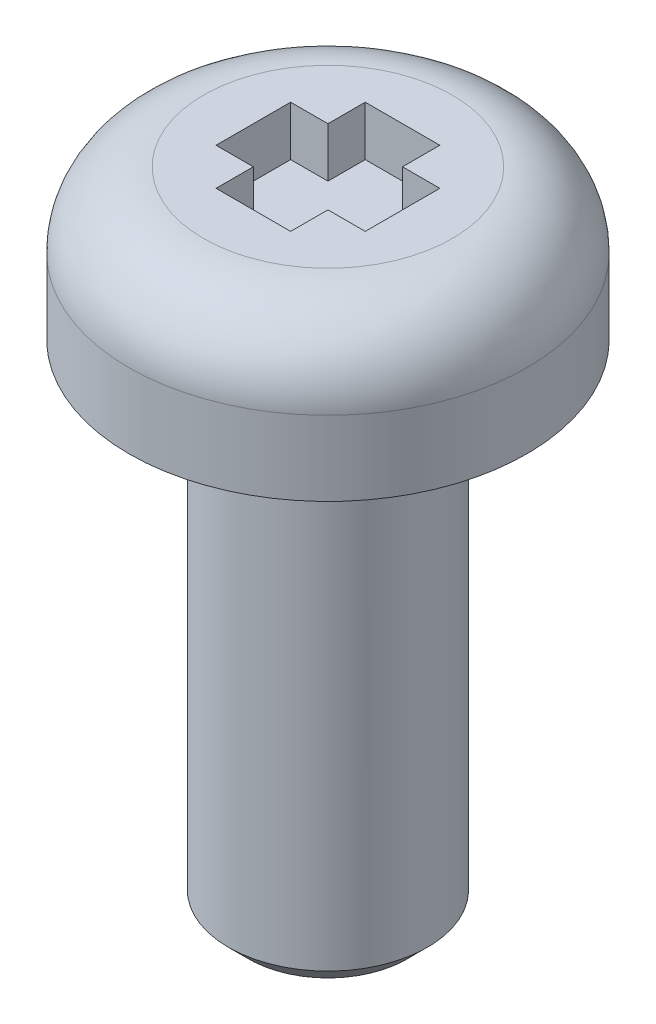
ISO-10303-21;
HEADER;
FILE_DESCRIPTION(('STEP AP214'),'2;1');
FILE_NAME('part.step','',(''),(''),'','','');
FILE_SCHEMA(('AUTOMOTIVE_DESIGN { 1 0 10303 214 1 1 1 1 }'));
ENDSEC;
DATA;
#1=APPLICATION_CONTEXT('core data for automotive mechanical design processes');
#2=APPLICATION_PROTOCOL_DEFINITION('international standard','automotive_design',2000,#1);
#3=PRODUCT_CONTEXT('',#1,'mechanical');
#4=PRODUCT('Part','Part','',(#3));
#5=PRODUCT_RELATED_PRODUCT_CATEGORY('part','',(#4));
#6=PRODUCT_DEFINITION_FORMATION('','',#4);
#7=PRODUCT_DEFINITION_CONTEXT('part definition',#1,'design');
#8=PRODUCT_DEFINITION('design','',#6,#7);
#9=PRODUCT_DEFINITION_SHAPE('','',#8);
#10=(LENGTH_UNIT() NAMED_UNIT(*) SI_UNIT(.MILLI.,.METRE.));
#11=(NAMED_UNIT(*) PLANE_ANGLE_UNIT() SI_UNIT($,.RADIAN.));
#12=(NAMED_UNIT(*) SI_UNIT($,.STERADIAN.) SOLID_ANGLE_UNIT());
#13=UNCERTAINTY_MEASURE_WITH_UNIT(LENGTH_MEASURE(1.E-05),#10,'distance_accuracy_value','');
#14=(GEOMETRIC_REPRESENTATION_CONTEXT(3) GLOBAL_UNCERTAINTY_ASSIGNED_CONTEXT((#13)) GLOBAL_UNIT_ASSIGNED_CONTEXT((#10,
#11,#12)) REPRESENTATION_CONTEXT('',''));
#15=CARTESIAN_POINT('',(0.,0.,0.));
#16=DIRECTION('',(0.,0.,1.));
#17=DIRECTION('',(1.,0.,0.));
#18=AXIS2_PLACEMENT_3D('',#15,#16,#17);
#19=CARTESIAN_POINT('',(4.,0.,0.));
#20=DIRECTION('',(0.,1.,0.));
#21=DIRECTION('',(0.,0.,1.));
#22=AXIS2_PLACEMENT_3D('',#19,#20,#21);
#23=PLANE('',#22);
#24=CARTESIAN_POINT('',(0.,0.,0.));
#25=DIRECTION('',(0.,1.,0.));
#26=DIRECTION('',(0.,0.,1.));
#27=AXIS2_PLACEMENT_3D('',#24,#25,#26);
#28=CIRCLE('',#27,2.4572);
#29=CARTESIAN_POINT('',(0.,0.,2.4572));
#30=VERTEX_POINT('',#29);
#31=EDGE_CURVE('E214',#30,#30,#28,.T.);
#32=ORIENTED_EDGE('',*,*,#31,.T.);
#33=EDGE_LOOP('',(#32));
#34=FACE_BOUND('',#33,.T.);
#35=CARTESIAN_POINT('',(0.,0.,0.));
#36=DIRECTION('',(0.,1.,0.));
#37=DIRECTION('',(0.,0.,1.));
#38=AXIS2_PLACEMENT_3D('',#35,#36,#37);
#39=CIRCLE('',#38,4.);
#40=CARTESIAN_POINT('',(0.,0.,4.));
#41=VERTEX_POINT('',#40);
#42=EDGE_CURVE('E208',#41,#41,#39,.T.);
#43=ORIENTED_EDGE('',*,*,#42,.F.);
#44=EDGE_LOOP('',(#43));
#45=FACE_BOUND('',#44,.T.);
#46=ADVANCED_FACE('F36',(#34,#45),#23,.F.);
#47=CARTESIAN_POINT('',(0.750000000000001,2.,1.5));
#48=DIRECTION('',(1.,0.,0.));
#49=DIRECTION('',(0.,0.,-1.));
#50=AXIS2_PLACEMENT_3D('',#47,#48,#49);
#51=PLANE('',#50);
#52=DIRECTION('',(0.,1.,0.));
#53=VECTOR('',#52,1.);
#54=CARTESIAN_POINT('',(0.75,2.,0.749999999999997));
#55=LINE('',#54,#53);
#56=CARTESIAN_POINT('',(0.750000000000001,2.,0.749999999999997));
#57=VERTEX_POINT('',#56);
#58=CARTESIAN_POINT('',(0.75,3.,0.749999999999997));
#59=VERTEX_POINT('',#58);
#60=EDGE_CURVE('E158',#57,#59,#55,.T.);
#61=ORIENTED_EDGE('',*,*,#60,.F.);
#62=DIRECTION('',(0.,0.,-1.));
#63=VECTOR('',#62,1.);
#64=CARTESIAN_POINT('',(0.750000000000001,2.,1.5));
#65=LINE('',#64,#63);
#66=CARTESIAN_POINT('',(0.750000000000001,2.,1.5));
#67=VERTEX_POINT('',#66);
#68=EDGE_CURVE('E167',#67,#57,#65,.T.);
#69=ORIENTED_EDGE('',*,*,#68,.F.);
#70=DIRECTION('',(0.,1.,0.));
#71=VECTOR('',#70,1.);
#72=CARTESIAN_POINT('',(0.750000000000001,2.,1.5));
#73=LINE('',#72,#71);
#74=CARTESIAN_POINT('',(0.750000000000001,3.,1.5));
#75=VERTEX_POINT('',#74);
#76=EDGE_CURVE('E193',#67,#75,#73,.T.);
#77=ORIENTED_EDGE('',*,*,#76,.T.);
#78=DIRECTION('',(0.,0.,-1.));
#79=VECTOR('',#78,1.);
#80=CARTESIAN_POINT('',(0.750000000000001,3.,1.5));
#81=LINE('',#80,#79);
#82=EDGE_CURVE('E180',#75,#59,#81,.T.);
#83=ORIENTED_EDGE('',*,*,#82,.T.);
#84=EDGE_LOOP('',(#61,#69,#77,#83));
#85=FACE_BOUND('',#84,.T.);
#86=ADVANCED_FACE('F230',(#85),#51,.F.);
#87=CARTESIAN_POINT('',(-0.749999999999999,2.,1.5));
#88=DIRECTION('',(1.,0.,0.));
#89=DIRECTION('',(0.,0.,-1.));
#90=AXIS2_PLACEMENT_3D('',#87,#88,#89);
#91=PLANE('',#90);
#92=DIRECTION('',(0.,0.,-1.));
#93=VECTOR('',#92,1.);
#94=CARTESIAN_POINT('',(-0.749999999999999,2.,1.5));
#95=LINE('',#94,#93);
#96=CARTESIAN_POINT('',(-0.749999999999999,2.,1.5));
#97=VERTEX_POINT('',#96);
#98=CARTESIAN_POINT('',(-0.75,2.,0.75));
#99=VERTEX_POINT('',#98);
#100=EDGE_CURVE('E174',#97,#99,#95,.T.);
#101=ORIENTED_EDGE('',*,*,#100,.T.);
#102=DIRECTION('',(0.,1.,0.));
#103=VECTOR('',#102,1.);
#104=CARTESIAN_POINT('',(-0.75,2.,0.750000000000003));
#105=LINE('',#104,#103);
#106=CARTESIAN_POINT('',(-0.75,3.,0.750000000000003));
#107=VERTEX_POINT('',#106);
#108=EDGE_CURVE('E155',#99,#107,#105,.T.);
#109=ORIENTED_EDGE('',*,*,#108,.T.);
#110=DIRECTION('',(0.,0.,-1.));
#111=VECTOR('',#110,1.);
#112=CARTESIAN_POINT('',(-0.749999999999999,3.,1.5));
#113=LINE('',#112,#111);
#114=CARTESIAN_POINT('',(-0.749999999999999,3.,1.5));
#115=VERTEX_POINT('',#114);
#116=EDGE_CURVE('E187',#115,#107,#113,.T.);
#117=ORIENTED_EDGE('',*,*,#116,.F.);
#118=DIRECTION('',(0.,1.,0.));
#119=VECTOR('',#118,1.);
#120=CARTESIAN_POINT('',(-0.749999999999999,2.,1.5));
#121=LINE('',#120,#119);
#122=EDGE_CURVE('E196',#97,#115,#121,.T.);
#123=ORIENTED_EDGE('',*,*,#122,.F.);
#124=EDGE_LOOP('',(#101,#109,#117,#123));
#125=FACE_BOUND('',#124,.T.);
#126=ADVANCED_FACE('F236',(#125),#91,.T.);
#127=CARTESIAN_POINT('',(0.,11.592517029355,0.));
#128=DIRECTION('',(0.,1.,0.));
#129=DIRECTION('',(0.,0.,1.));
#130=AXIS2_PLACEMENT_3D('',#127,#128,#129);
#131=CYLINDRICAL_SURFACE('',#130,4.);
#132=CARTESIAN_POINT('',(0.,1.5,0.));
#133=DIRECTION('',(0.,1.,0.));
#134=DIRECTION('',(0.,0.,1.));
#135=AXIS2_PLACEMENT_3D('',#132,#133,#134);
#136=CIRCLE('',#135,4.);
#137=CARTESIAN_POINT('',(0.,1.5,4.));
#138=VERTEX_POINT('',#137);
#139=EDGE_CURVE('E205',#138,#138,#136,.T.);
#140=ORIENTED_EDGE('',*,*,#139,.F.);
#141=EDGE_LOOP('',(#140));
#142=FACE_BOUND('',#141,.T.);
#143=ORIENTED_EDGE('',*,*,#42,.T.);
#144=EDGE_LOOP('',(#143));
#145=FACE_BOUND('',#144,.T.);
#146=ADVANCED_FACE('F242',(#142,#145),#131,.T.);
#147=CARTESIAN_POINT('',(0.,1.5,0.));
#148=DIRECTION('',(0.,1.,0.));
#149=DIRECTION('',(0.,0.,1.));
#150=AXIS2_PLACEMENT_3D('',#147,#148,#149);
#151=TOROIDAL_SURFACE('',#150,2.5,1.5);
#152=CARTESIAN_POINT('',(0.,3.,0.));
#153=DIRECTION('',(0.,1.,0.));
#154=DIRECTION('',(0.,0.,1.));
#155=AXIS2_PLACEMENT_3D('',#152,#153,#154);
#156=CIRCLE('',#155,2.5);
#157=CARTESIAN_POINT('',(0.,3.,2.5));
#158=VERTEX_POINT('',#157);
#159=EDGE_CURVE('E195',#158,#158,#156,.T.);
#160=ORIENTED_EDGE('',*,*,#159,.F.);
#161=EDGE_LOOP('',(#160));
#162=FACE_BOUND('',#161,.T.);
#163=ORIENTED_EDGE('',*,*,#139,.T.);
#164=EDGE_LOOP('',(#163));
#165=FACE_BOUND('',#164,.T.);
#166=ADVANCED_FACE('F245',(#162,#165),#151,.T.);
#167=CARTESIAN_POINT('',(0.,3.,0.));
#168=DIRECTION('',(0.,-1.,0.));
#169=DIRECTION('',(0.,0.,-1.));
#170=AXIS2_PLACEMENT_3D('',#167,#168,#169);
#171=PLANE('',#170);
#172=CARTESIAN_POINT('',(0.75,3.,-0.750000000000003));
#173=VERTEX_POINT('',#172);
#174=CARTESIAN_POINT('',(0.75,3.,-1.5));
#175=VERTEX_POINT('',#174);
#176=EDGE_CURVE('E166',#173,#175,#81,.T.);
#177=ORIENTED_EDGE('',*,*,#176,.F.);
#178=DIRECTION('',(-1.,0.,0.));
#179=VECTOR('',#178,1.);
#180=CARTESIAN_POINT('',(1.5,3.,-0.750000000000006));
#181=LINE('',#180,#179);
#182=CARTESIAN_POINT('',(1.5,3.,-0.750000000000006));
#183=VERTEX_POINT('',#182);
#184=EDGE_CURVE('E443',#183,#173,#181,.T.);
#185=ORIENTED_EDGE('',*,*,#184,.F.);
#186=DIRECTION('',(0.,0.,1.));
#187=VECTOR('',#186,1.);
#188=CARTESIAN_POINT('',(1.5,3.,-0.750000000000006));
#189=LINE('',#188,#187);
#190=CARTESIAN_POINT('',(1.5,3.,0.749999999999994));
#191=VERTEX_POINT('',#190);
#192=EDGE_CURVE('E133',#183,#191,#189,.T.);
#193=ORIENTED_EDGE('',*,*,#192,.T.);
#194=DIRECTION('',(-1.,0.,0.));
#195=VECTOR('',#194,1.);
#196=CARTESIAN_POINT('',(1.5,3.,0.749999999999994));
#197=LINE('',#196,#195);
#198=EDGE_CURVE('E428',#191,#59,#197,.T.);
#199=ORIENTED_EDGE('',*,*,#198,.T.);
#200=ORIENTED_EDGE('',*,*,#82,.F.);
#201=DIRECTION('',(-1.,0.,0.));
#202=VECTOR('',#201,1.);
#203=CARTESIAN_POINT('',(0.750000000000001,3.,1.5));
#204=LINE('',#203,#202);
#205=EDGE_CURVE('E190',#75,#115,#204,.T.);
#206=ORIENTED_EDGE('',*,*,#205,.T.);
#207=ORIENTED_EDGE('',*,*,#116,.T.);
#208=CARTESIAN_POINT('',(-1.5,3.,0.750000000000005));
#209=VERTEX_POINT('',#208);
#210=EDGE_CURVE('E434',#107,#209,#197,.T.);
#211=ORIENTED_EDGE('',*,*,#210,.T.);
#212=DIRECTION('',(0.,0.,-1.));
#213=VECTOR('',#212,1.);
#214=CARTESIAN_POINT('',(-1.5,3.,0.750000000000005));
#215=LINE('',#214,#213);
#216=CARTESIAN_POINT('',(-1.5,3.,-0.749999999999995));
#217=VERTEX_POINT('',#216);
#218=EDGE_CURVE('E438',#209,#217,#215,.T.);
#219=ORIENTED_EDGE('',*,*,#218,.T.);
#220=CARTESIAN_POINT('',(-0.75,3.,-0.749999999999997));
#221=VERTEX_POINT('',#220);
#222=EDGE_CURVE('E146',#221,#217,#181,.T.);
#223=ORIENTED_EDGE('',*,*,#222,.F.);
#224=CARTESIAN_POINT('',(-0.75,3.,-1.5));
#225=VERTEX_POINT('',#224);
#226=EDGE_CURVE('E186',#221,#225,#113,.T.);
#227=ORIENTED_EDGE('',*,*,#226,.T.);
#228=DIRECTION('',(1.,0.,0.));
#229=VECTOR('',#228,1.);
#230=CARTESIAN_POINT('',(-0.75,3.,-1.5));
#231=LINE('',#230,#229);
#232=EDGE_CURVE('E183',#225,#175,#231,.T.);
#233=ORIENTED_EDGE('',*,*,#232,.T.);
#234=EDGE_LOOP('',(#177,#185,#193,#199,#200,#206,#207,#211,#219,#223,#227,#233));
#235=FACE_BOUND('',#234,.T.);
#236=ORIENTED_EDGE('',*,*,#159,.T.);
#237=EDGE_LOOP('',(#236));
#238=FACE_BOUND('',#237,.T.);
#239=ADVANCED_FACE('F249',(#235,#238),#171,.F.);
#240=CARTESIAN_POINT('',(0.75,2.,-0.75));
#241=VERTEX_POINT('',#240);
#242=CARTESIAN_POINT('',(0.75,2.,-1.5));
#243=VERTEX_POINT('',#242);
#244=EDGE_CURVE('E171',#241,#243,#65,.T.);
#245=ORIENTED_EDGE('',*,*,#244,.F.);
#246=DIRECTION('',(0.,1.,0.));
#247=VECTOR('',#246,1.);
#248=CARTESIAN_POINT('',(0.75,2.,-0.750000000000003));
#249=LINE('',#248,#247);
#250=EDGE_CURVE('E163',#241,#173,#249,.T.);
#251=ORIENTED_EDGE('',*,*,#250,.T.);
#252=ORIENTED_EDGE('',*,*,#176,.T.);
#253=DIRECTION('',(0.,1.,0.));
#254=VECTOR('',#253,1.);
#255=CARTESIAN_POINT('',(0.75,2.,-1.5));
#256=LINE('',#255,#254);
#257=EDGE_CURVE('E179',#243,#175,#256,.T.);
#258=ORIENTED_EDGE('',*,*,#257,.F.);
#259=EDGE_LOOP('',(#245,#251,#252,#258));
#260=FACE_BOUND('',#259,.T.);
#261=ADVANCED_FACE('F239',(#260),#51,.F.);
#262=CARTESIAN_POINT('',(0.750000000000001,2.,1.5));
#263=DIRECTION('',(0.,0.,-1.));
#264=DIRECTION('',(-1.,0.,0.));
#265=AXIS2_PLACEMENT_3D('',#262,#263,#264);
#266=PLANE('',#265);
#267=ORIENTED_EDGE('',*,*,#205,.F.);
#268=ORIENTED_EDGE('',*,*,#76,.F.);
#269=DIRECTION('',(-1.,0.,0.));
#270=VECTOR('',#269,1.);
#271=CARTESIAN_POINT('',(0.750000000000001,2.,1.5));
#272=LINE('',#271,#270);
#273=EDGE_CURVE('E177',#67,#97,#272,.T.);
#274=ORIENTED_EDGE('',*,*,#273,.T.);
#275=ORIENTED_EDGE('',*,*,#122,.T.);
#276=EDGE_LOOP('',(#267,#268,#274,#275));
#277=FACE_BOUND('',#276,.T.);
#278=ADVANCED_FACE('F255',(#277),#266,.T.);
#279=DIRECTION('',(0.,1.,0.));
#280=VECTOR('',#279,1.);
#281=CARTESIAN_POINT('',(-0.75,2.,-0.749999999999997));
#282=LINE('',#281,#280);
#283=CARTESIAN_POINT('',(-0.75,2.,-0.749999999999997));
#284=VERTEX_POINT('',#283);
#285=EDGE_CURVE('E161',#284,#221,#282,.T.);
#286=ORIENTED_EDGE('',*,*,#285,.F.);
#287=CARTESIAN_POINT('',(-0.75,2.,-1.5));
#288=VERTEX_POINT('',#287);
#289=EDGE_CURVE('E129',#284,#288,#95,.T.);
#290=ORIENTED_EDGE('',*,*,#289,.T.);
#291=DIRECTION('',(0.,1.,0.));
#292=VECTOR('',#291,1.);
#293=CARTESIAN_POINT('',(-0.75,2.,-1.5));
#294=LINE('',#293,#292);
#295=EDGE_CURVE('E198',#288,#225,#294,.T.);
#296=ORIENTED_EDGE('',*,*,#295,.T.);
#297=ORIENTED_EDGE('',*,*,#226,.F.);
#298=EDGE_LOOP('',(#286,#290,#296,#297));
#299=FACE_BOUND('',#298,.T.);
#300=ADVANCED_FACE('F260',(#299),#91,.T.);
#301=CARTESIAN_POINT('',(-0.75,2.,-1.5));
#302=DIRECTION('',(0.,0.,1.));
#303=DIRECTION('',(1.,0.,0.));
#304=AXIS2_PLACEMENT_3D('',#301,#302,#303);
#305=PLANE('',#304);
#306=ORIENTED_EDGE('',*,*,#232,.F.);
#307=ORIENTED_EDGE('',*,*,#295,.F.);
#308=DIRECTION('',(1.,0.,0.));
#309=VECTOR('',#308,1.);
#310=CARTESIAN_POINT('',(-0.75,2.,-1.5));
#311=LINE('',#310,#309);
#312=EDGE_CURVE('E170',#288,#243,#311,.T.);
#313=ORIENTED_EDGE('',*,*,#312,.T.);
#314=ORIENTED_EDGE('',*,*,#257,.T.);
#315=EDGE_LOOP('',(#306,#307,#313,#314));
#316=FACE_BOUND('',#315,.T.);
#317=ADVANCED_FACE('F257',(#316),#305,.T.);
#318=CARTESIAN_POINT('',(0.75,2.,-1.5));
#319=DIRECTION('',(0.,-1.,0.));
#320=DIRECTION('',(0.,0.,-1.));
#321=AXIS2_PLACEMENT_3D('',#318,#319,#320);
#322=PLANE('',#321);
#323=ORIENTED_EDGE('',*,*,#289,.F.);
#324=DIRECTION('',(-1.,0.,0.));
#325=VECTOR('',#324,1.);
#326=CARTESIAN_POINT('',(1.5,2.,-0.750000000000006));
#327=LINE('',#326,#325);
#328=CARTESIAN_POINT('',(-1.5,2.,-0.749999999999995));
#329=VERTEX_POINT('',#328);
#330=EDGE_CURVE('E124',#284,#329,#327,.T.);
#331=ORIENTED_EDGE('',*,*,#330,.T.);
#332=DIRECTION('',(0.,0.,-1.));
#333=VECTOR('',#332,1.);
#334=CARTESIAN_POINT('',(-1.5,2.,0.750000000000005));
#335=LINE('',#334,#333);
#336=CARTESIAN_POINT('',(-1.5,2.,0.750000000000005));
#337=VERTEX_POINT('',#336);
#338=EDGE_CURVE('E127',#337,#329,#335,.T.);
#339=ORIENTED_EDGE('',*,*,#338,.F.);
#340=DIRECTION('',(-1.,0.,0.));
#341=VECTOR('',#340,1.);
#342=CARTESIAN_POINT('',(1.5,2.,0.749999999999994));
#343=LINE('',#342,#341);
#344=EDGE_CURVE('E51',#99,#337,#343,.T.);
#345=ORIENTED_EDGE('',*,*,#344,.F.);
#346=ORIENTED_EDGE('',*,*,#100,.F.);
#347=ORIENTED_EDGE('',*,*,#273,.F.);
#348=ORIENTED_EDGE('',*,*,#68,.T.);
#349=CARTESIAN_POINT('',(1.5,2.,0.749999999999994));
#350=VERTEX_POINT('',#349);
#351=EDGE_CURVE('E151',#350,#57,#343,.T.);
#352=ORIENTED_EDGE('',*,*,#351,.F.);
#353=DIRECTION('',(0.,0.,1.));
#354=VECTOR('',#353,1.);
#355=CARTESIAN_POINT('',(1.5,2.,-0.750000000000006));
#356=LINE('',#355,#354);
#357=CARTESIAN_POINT('',(1.5,2.,-0.750000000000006));
#358=VERTEX_POINT('',#357);
#359=EDGE_CURVE('E147',#358,#350,#356,.T.);
#360=ORIENTED_EDGE('',*,*,#359,.F.);
#361=EDGE_CURVE('E58',#358,#241,#327,.T.);
#362=ORIENTED_EDGE('',*,*,#361,.T.);
#363=ORIENTED_EDGE('',*,*,#244,.T.);
#364=ORIENTED_EDGE('',*,*,#312,.F.);
#365=EDGE_LOOP('',(#323,#331,#339,#345,#346,#347,#348,#352,#360,#362,#363,#364));
#366=FACE_BOUND('',#365,.T.);
#367=ADVANCED_FACE('F126',(#366),#322,.F.);
#368=CARTESIAN_POINT('',(1.5,2.,0.749999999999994));
#369=DIRECTION('',(0.,0.,-1.));
#370=DIRECTION('',(-1.,0.,0.));
#371=AXIS2_PLACEMENT_3D('',#368,#369,#370);
#372=PLANE('',#371);
#373=ORIENTED_EDGE('',*,*,#344,.T.);
#374=DIRECTION('',(0.,1.,0.));
#375=VECTOR('',#374,1.);
#376=CARTESIAN_POINT('',(-1.5,2.,0.750000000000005));
#377=LINE('',#376,#375);
#378=EDGE_CURVE('E142',#337,#209,#377,.T.);
#379=ORIENTED_EDGE('',*,*,#378,.T.);
#380=ORIENTED_EDGE('',*,*,#210,.F.);
#381=ORIENTED_EDGE('',*,*,#108,.F.);
#382=EDGE_LOOP('',(#373,#379,#380,#381));
#383=FACE_BOUND('',#382,.T.);
#384=ADVANCED_FACE('F270',(#383),#372,.T.);
#385=CARTESIAN_POINT('',(1.5,2.,-0.750000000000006));
#386=DIRECTION('',(0.,0.,-1.));
#387=DIRECTION('',(-1.,0.,0.));
#388=AXIS2_PLACEMENT_3D('',#385,#386,#387);
#389=PLANE('',#388);
#390=ORIENTED_EDGE('',*,*,#285,.T.);
#391=ORIENTED_EDGE('',*,*,#222,.T.);
#392=DIRECTION('',(0.,1.,0.));
#393=VECTOR('',#392,1.);
#394=CARTESIAN_POINT('',(-1.5,2.,-0.749999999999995));
#395=LINE('',#394,#393);
#396=EDGE_CURVE('E140',#329,#217,#395,.T.);
#397=ORIENTED_EDGE('',*,*,#396,.F.);
#398=ORIENTED_EDGE('',*,*,#330,.F.);
#399=EDGE_LOOP('',(#390,#391,#397,#398));
#400=FACE_BOUND('',#399,.T.);
#401=ADVANCED_FACE('F144',(#400),#389,.F.);
#402=CARTESIAN_POINT('',(-1.5,2.,0.750000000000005));
#403=DIRECTION('',(1.,0.,0.));
#404=DIRECTION('',(0.,0.,-1.));
#405=AXIS2_PLACEMENT_3D('',#402,#403,#404);
#406=PLANE('',#405);
#407=ORIENTED_EDGE('',*,*,#218,.F.);
#408=ORIENTED_EDGE('',*,*,#378,.F.);
#409=ORIENTED_EDGE('',*,*,#338,.T.);
#410=ORIENTED_EDGE('',*,*,#396,.T.);
#411=EDGE_LOOP('',(#407,#408,#409,#410));
#412=FACE_BOUND('',#411,.T.);
#413=ADVANCED_FACE('F139',(#412),#406,.T.);
#414=ORIENTED_EDGE('',*,*,#361,.F.);
#415=DIRECTION('',(0.,1.,0.));
#416=VECTOR('',#415,1.);
#417=CARTESIAN_POINT('',(1.5,2.,-0.750000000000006));
#418=LINE('',#417,#416);
#419=EDGE_CURVE('E159',#358,#183,#418,.T.);
#420=ORIENTED_EDGE('',*,*,#419,.T.);
#421=ORIENTED_EDGE('',*,*,#184,.T.);
#422=ORIENTED_EDGE('',*,*,#250,.F.);
#423=EDGE_LOOP('',(#414,#420,#421,#422));
#424=FACE_BOUND('',#423,.T.);
#425=ADVANCED_FACE('F273',(#424),#389,.F.);
#426=ORIENTED_EDGE('',*,*,#60,.T.);
#427=ORIENTED_EDGE('',*,*,#198,.F.);
#428=DIRECTION('',(0.,1.,0.));
#429=VECTOR('',#428,1.);
#430=CARTESIAN_POINT('',(1.5,2.,0.749999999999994));
#431=LINE('',#430,#429);
#432=EDGE_CURVE('E149',#350,#191,#431,.T.);
#433=ORIENTED_EDGE('',*,*,#432,.F.);
#434=ORIENTED_EDGE('',*,*,#351,.T.);
#435=EDGE_LOOP('',(#426,#427,#433,#434));
#436=FACE_BOUND('',#435,.T.);
#437=ADVANCED_FACE('F279',(#436),#372,.T.);
#438=CARTESIAN_POINT('',(1.5,2.,-0.750000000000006));
#439=DIRECTION('',(-1.,0.,0.));
#440=DIRECTION('',(0.,0.,1.));
#441=AXIS2_PLACEMENT_3D('',#438,#439,#440);
#442=PLANE('',#441);
#443=ORIENTED_EDGE('',*,*,#192,.F.);
#444=ORIENTED_EDGE('',*,*,#419,.F.);
#445=ORIENTED_EDGE('',*,*,#359,.T.);
#446=ORIENTED_EDGE('',*,*,#432,.T.);
#447=EDGE_LOOP('',(#443,#444,#445,#446));
#448=FACE_BOUND('',#447,.T.);
#449=ADVANCED_FACE('F280',(#448),#442,.T.);
#450=CARTESIAN_POINT('',(0.,-10.,0.));
#451=DIRECTION('',(0.,1.,0.));
#452=DIRECTION('',(0.,0.,1.));
#453=AXIS2_PLACEMENT_3D('',#450,#451,#452);
#454=CYLINDRICAL_SURFACE('',#453,2.);
#455=CARTESIAN_POINT('',(0.,-9.5936,0.));
#456=DIRECTION('',(0.,-1.,0.));
#457=DIRECTION('',(0.,0.,-1.));
#458=AXIS2_PLACEMENT_3D('',#455,#456,#457);
#459=CIRCLE('',#458,2.);
#460=CARTESIAN_POINT('',(0.,-9.5936,-2.));
#461=VERTEX_POINT('',#460);
#462=EDGE_CURVE('E11',#461,#461,#459,.F.);
#463=ORIENTED_EDGE('',*,*,#462,.T.);
#464=EDGE_LOOP('',(#463));
#465=FACE_BOUND('',#464,.T.);
#466=CARTESIAN_POINT('',(0.,-0.4572,0.));
#467=DIRECTION('',(0.,1.,0.));
#468=DIRECTION('',(0.,0.,1.));
#469=AXIS2_PLACEMENT_3D('',#466,#467,#468);
#470=CIRCLE('',#469,2.);
#471=CARTESIAN_POINT('',(0.,-0.4572,2.));
#472=VERTEX_POINT('',#471);
#473=EDGE_CURVE('E211',#472,#472,#470,.F.);
#474=ORIENTED_EDGE('',*,*,#473,.T.);
#475=EDGE_LOOP('',(#474));
#476=FACE_BOUND('',#475,.T.);
#477=ADVANCED_FACE('F283',(#465,#476),#454,.T.);
#478=CARTESIAN_POINT('',(0.,-10.,0.));
#479=DIRECTION('',(0.,-1.,0.));
#480=DIRECTION('',(0.,0.,-1.));
#481=AXIS2_PLACEMENT_3D('',#478,#479,#480);
#482=PLANE('',#481);
#483=CARTESIAN_POINT('',(0.,-10.,0.));
#484=DIRECTION('',(0.,-1.,0.));
#485=DIRECTION('',(0.,0.,-1.));
#486=AXIS2_PLACEMENT_3D('',#483,#484,#485);
#487=CIRCLE('',#486,1.5936);
#488=CARTESIAN_POINT('',(0.,-10.,-1.5936));
#489=VERTEX_POINT('',#488);
#490=EDGE_CURVE('E44',#489,#489,#487,.T.);
#491=ORIENTED_EDGE('',*,*,#490,.T.);
#492=EDGE_LOOP('',(#491));
#493=FACE_BOUND('',#492,.T.);
#494=ADVANCED_FACE('F219',(#493),#482,.T.);
#495=CARTESIAN_POINT('',(0.,-0.4572,0.));
#496=DIRECTION('',(0.,1.,0.));
#497=DIRECTION('',(0.,0.,1.));
#498=AXIS2_PLACEMENT_3D('',#495,#496,#497);
#499=TOROIDAL_SURFACE('',#498,2.4572,0.4572);
#500=ORIENTED_EDGE('',*,*,#31,.F.);
#501=EDGE_LOOP('',(#500));
#502=FACE_BOUND('',#501,.T.);
#503=ORIENTED_EDGE('',*,*,#473,.F.);
#504=EDGE_LOOP('',(#503));
#505=FACE_BOUND('',#504,.T.);
#506=ADVANCED_FACE('F222',(#502,#505),#499,.F.);
#507=CARTESIAN_POINT('',(0.,-10.,0.));
#508=DIRECTION('',(0.,1.,0.));
#509=DIRECTION('',(0.,0.,1.));
#510=AXIS2_PLACEMENT_3D('',#507,#508,#509);
#511=CONICAL_SURFACE('',#510,1.5936,0.785398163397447);
#512=ORIENTED_EDGE('',*,*,#462,.F.);
#513=EDGE_LOOP('',(#512));
#514=FACE_BOUND('',#513,.T.);
#515=ORIENTED_EDGE('',*,*,#490,.F.);
#516=EDGE_LOOP('',(#515));
#517=FACE_BOUND('',#516,.T.);
#518=ADVANCED_FACE('F38',(#514,#517),#511,.T.);
#519=CLOSED_SHELL('',(#46,#86,#126,#146,#166,#239,#261,#278,#300,#317,#367,#384,#401,#413,#425,
#437,#449,#477,#494,#506,#518));
#520=MANIFOLD_SOLID_BREP('B2',#519);
#521=ADVANCED_BREP_SHAPE_REPRESENTATION('',(#18,#520),#14);
#522=SHAPE_DEFINITION_REPRESENTATION(#9,#521);
ENDSEC;
END-ISO-10303-21;
